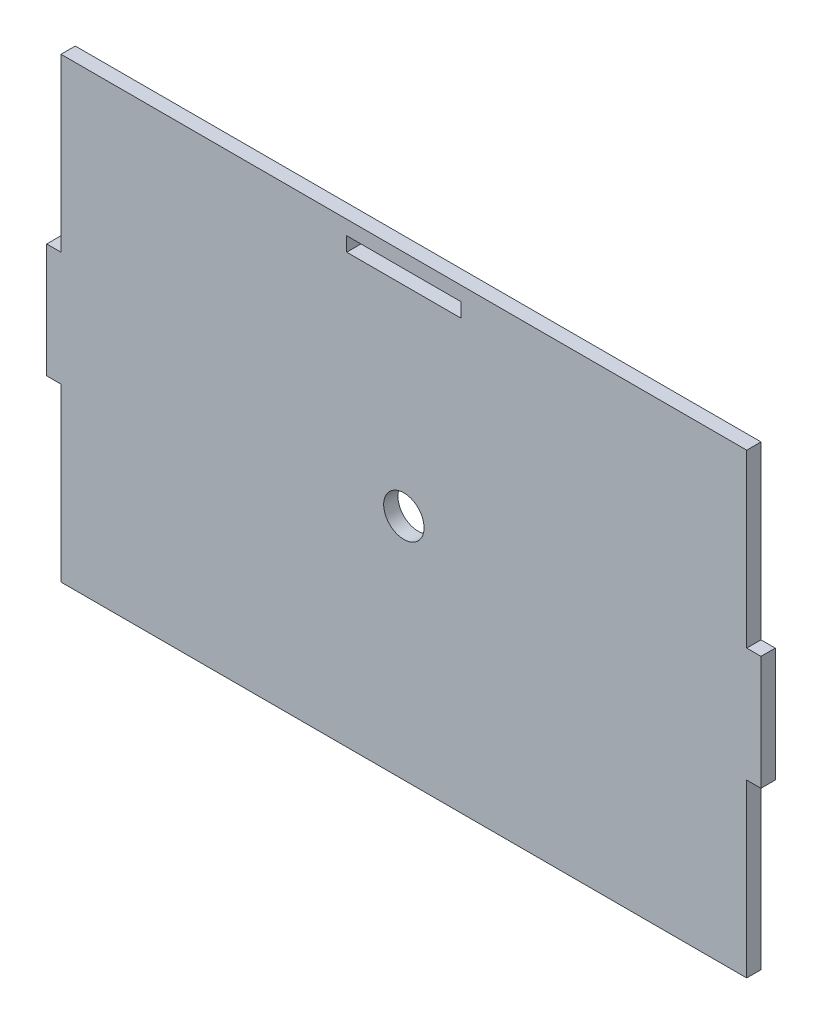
from build123d import *

# Parameters (mm, degrees)
SKETCH1_R           = 4.490128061
SKETCH1_W           = 25.4
SKETCH1_H           = 3.175
BOSS_EXTRUDE1_DEPTH = 3.175


with BuildPart() as part:
    # Sketch1 → Boss-Extrude1 (new body)
    with BuildSketch(Plane.XY):
        Polygon((36.397049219, 36.697675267), (87.197049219, 36.697675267), (87.197049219, -1.402324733), (90.372049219, -1.402324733), (90.372049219, -26.802324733), (87.197049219, -26.802324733), (87.197049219, -64.902324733), (-65.202950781, -64.902324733), (-65.202950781, -26.802324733), (-68.377950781, -26.802324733), (-68.377950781, -1.402324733), (-65.202950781, -1.402324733), (-65.202950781, 36.697675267), (-14.402950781, 36.697675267), align=None)
        with Locations((10.997049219, -14.102324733)):
            Circle(SKETCH1_R, mode=Mode.SUBTRACT)
        with Locations((10.997049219, 31.935175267)):
            Rectangle(SKETCH1_W, SKETCH1_H, mode=Mode.SUBTRACT)
    extrude(amount=BOSS_EXTRUDE1_DEPTH)


solid = part.part
